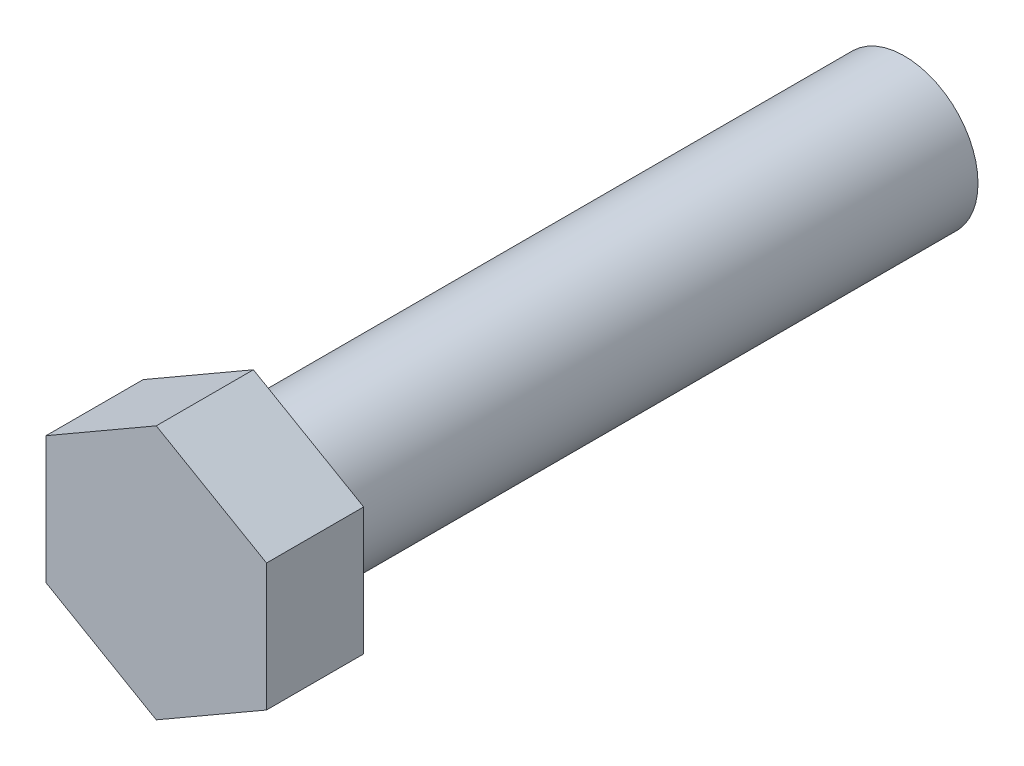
from build123d import *

# Parameters (mm, degrees)
BOLT_HEAD_DEPTH = 58.7375
SK_BODY_R       = 44.45
BOLT_BODY_DEPTH = 393.7


with BuildPart() as part:
    # Sketch3 → bolt Head (new body)
    with BuildSketch(Plane(origin=(0, 0, 0), x_dir=(0, 1, 0), z_dir=(0, 0, 1))):
        Polygon((76.989658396, 0), (38.494829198, 66.675), (-38.494829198, 66.675), (-76.989658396, 0), (-38.494829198, -66.675), (38.494829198, -66.675), align=None)
    extrude(amount=BOLT_HEAD_DEPTH)

    # sk body → bolt Body (add)
    with BuildSketch(Plane(origin=(0, 0, 0), x_dir=(0, 1, 0), z_dir=(0, 0, 1))):
        with Locations(Location((0, 0, 0), (0, 0, 270))):
            Circle(SK_BODY_R)
    extrude(amount=-BOLT_BODY_DEPTH)


solid = part.part
